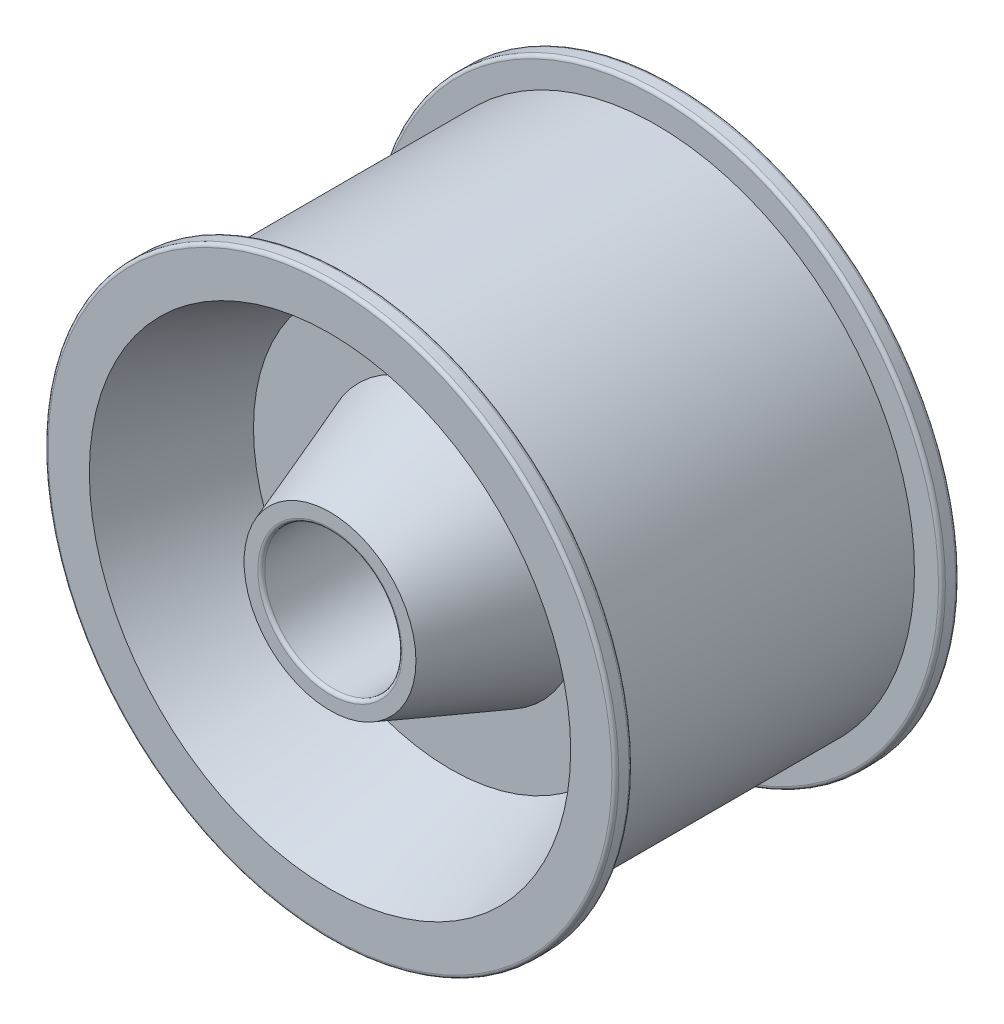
ISO-10303-21;
HEADER;
FILE_DESCRIPTION(('STEP AP214'),'2;1');
FILE_NAME('part.step','',(''),(''),'','','');
FILE_SCHEMA(('AUTOMOTIVE_DESIGN { 1 0 10303 214 1 1 1 1 }'));
ENDSEC;
DATA;
#1=APPLICATION_CONTEXT('core data for automotive mechanical design processes');
#2=APPLICATION_PROTOCOL_DEFINITION('international standard','automotive_design',2000,#1);
#3=PRODUCT_CONTEXT('',#1,'mechanical');
#4=PRODUCT('Part','Part','',(#3));
#5=PRODUCT_RELATED_PRODUCT_CATEGORY('part','',(#4));
#6=PRODUCT_DEFINITION_FORMATION('','',#4);
#7=PRODUCT_DEFINITION_CONTEXT('part definition',#1,'design');
#8=PRODUCT_DEFINITION('design','',#6,#7);
#9=PRODUCT_DEFINITION_SHAPE('','',#8);
#10=(LENGTH_UNIT() NAMED_UNIT(*) SI_UNIT(.MILLI.,.METRE.));
#11=(NAMED_UNIT(*) PLANE_ANGLE_UNIT() SI_UNIT($,.RADIAN.));
#12=(NAMED_UNIT(*) SI_UNIT($,.STERADIAN.) SOLID_ANGLE_UNIT());
#13=UNCERTAINTY_MEASURE_WITH_UNIT(LENGTH_MEASURE(1.E-05),#10,'distance_accuracy_value','');
#14=(GEOMETRIC_REPRESENTATION_CONTEXT(3) GLOBAL_UNCERTAINTY_ASSIGNED_CONTEXT((#13)) GLOBAL_UNIT_ASSIGNED_CONTEXT((#10,
#11,#12)) REPRESENTATION_CONTEXT('',''));
#15=CARTESIAN_POINT('',(0.,0.,0.));
#16=DIRECTION('',(0.,0.,1.));
#17=DIRECTION('',(1.,0.,0.));
#18=AXIS2_PLACEMENT_3D('',#15,#16,#17);
#19=CARTESIAN_POINT('',(0.,0.,-50.));
#20=DIRECTION('',(0.,0.,1.));
#21=DIRECTION('',(1.,0.,0.));
#22=AXIS2_PLACEMENT_3D('',#19,#20,#21);
#23=CONICAL_SURFACE('',#22,25.,0.349065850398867);
#24=CARTESIAN_POINT('',(0.,0.,-15.));
#25=DIRECTION('',(0.,0.,1.));
#26=DIRECTION('',(1.,0.,0.));
#27=AXIS2_PLACEMENT_3D('',#24,#25,#26);
#28=CIRCLE('',#27,37.7389581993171);
#29=CARTESIAN_POINT('',(37.7389581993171,0.,-15.));
#30=VERTEX_POINT('',#29);
#31=EDGE_CURVE('E10',#30,#30,#28,.T.);
#32=ORIENTED_EDGE('',*,*,#31,.F.);
#33=EDGE_LOOP('',(#32));
#34=FACE_BOUND('',#33,.T.);
#35=CARTESIAN_POINT('',(0.,0.,-50.));
#36=DIRECTION('',(0.,0.,1.));
#37=DIRECTION('',(1.,0.,0.));
#38=AXIS2_PLACEMENT_3D('',#35,#36,#37);
#39=CIRCLE('',#38,25.);
#40=CARTESIAN_POINT('',(25.,0.,-50.));
#41=VERTEX_POINT('',#40);
#42=EDGE_CURVE('E100',#41,#41,#39,.T.);
#43=ORIENTED_EDGE('',*,*,#42,.T.);
#44=EDGE_LOOP('',(#43));
#45=FACE_BOUND('',#44,.T.);
#46=ADVANCED_FACE('F30',(#34,#45),#23,.T.);
#47=CARTESIAN_POINT('',(0.,37.7389581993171,-15.));
#48=DIRECTION('',(0.,0.,1.));
#49=DIRECTION('',(1.,0.,0.));
#50=AXIS2_PLACEMENT_3D('',#47,#48,#49);
#51=PLANE('',#50);
#52=CARTESIAN_POINT('',(0.,0.,-15.));
#53=DIRECTION('',(0.,0.,1.));
#54=DIRECTION('',(1.,0.,0.));
#55=AXIS2_PLACEMENT_3D('',#52,#53,#54);
#56=CIRCLE('',#55,57.2610418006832);
#57=CARTESIAN_POINT('',(57.2610418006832,0.,-15.));
#58=VERTEX_POINT('',#57);
#59=EDGE_CURVE('E36',#58,#58,#56,.T.);
#60=ORIENTED_EDGE('',*,*,#59,.F.);
#61=EDGE_LOOP('',(#60));
#62=FACE_BOUND('',#61,.T.);
#63=ORIENTED_EDGE('',*,*,#31,.T.);
#64=EDGE_LOOP('',(#63));
#65=FACE_BOUND('',#64,.T.);
#66=ADVANCED_FACE('F221',(#62,#65),#51,.F.);
#67=CARTESIAN_POINT('',(0.,0.,-15.));
#68=DIRECTION('',(0.,0.,-1.));
#69=DIRECTION('',(-1.,0.,0.));
#70=AXIS2_PLACEMENT_3D('',#67,#68,#69);
#71=CONICAL_SURFACE('',#70,57.2610418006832,0.34906585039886);
#72=CARTESIAN_POINT('',(0.,0.,-50.));
#73=DIRECTION('',(0.,0.,1.));
#74=DIRECTION('',(1.,0.,0.));
#75=AXIS2_PLACEMENT_3D('',#72,#73,#74);
#76=CIRCLE('',#75,70.);
#77=CARTESIAN_POINT('',(70.,0.,-50.));
#78=VERTEX_POINT('',#77);
#79=EDGE_CURVE('E40',#78,#78,#76,.T.);
#80=ORIENTED_EDGE('',*,*,#79,.F.);
#81=EDGE_LOOP('',(#80));
#82=FACE_BOUND('',#81,.T.);
#83=ORIENTED_EDGE('',*,*,#59,.T.);
#84=EDGE_LOOP('',(#83));
#85=FACE_BOUND('',#84,.T.);
#86=ADVANCED_FACE('F216',(#82,#85),#71,.F.);
#87=CARTESIAN_POINT('',(0.,70.,-50.));
#88=DIRECTION('',(0.,0.,1.));
#89=DIRECTION('',(1.,0.,0.));
#90=AXIS2_PLACEMENT_3D('',#87,#88,#89);
#91=PLANE('',#90);
#92=CARTESIAN_POINT('',(0.,0.,-50.));
#93=DIRECTION('',(0.,0.,1.));
#94=DIRECTION('',(1.,0.,0.));
#95=AXIS2_PLACEMENT_3D('',#92,#93,#94);
#96=CIRCLE('',#95,82.);
#97=CARTESIAN_POINT('',(82.,0.,-50.));
#98=VERTEX_POINT('',#97);
#99=EDGE_CURVE('E44',#98,#98,#96,.T.);
#100=ORIENTED_EDGE('',*,*,#99,.F.);
#101=EDGE_LOOP('',(#100));
#102=FACE_BOUND('',#101,.T.);
#103=ORIENTED_EDGE('',*,*,#79,.T.);
#104=EDGE_LOOP('',(#103));
#105=FACE_BOUND('',#104,.T.);
#106=ADVANCED_FACE('F210',(#102,#105),#91,.F.);
#107=CARTESIAN_POINT('',(0.,0.,-49.));
#108=DIRECTION('',(0.,0.,1.));
#109=DIRECTION('',(1.,0.,0.));
#110=AXIS2_PLACEMENT_3D('',#107,#108,#109);
#111=TOROIDAL_SURFACE('',#110,82.,0.999999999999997);
#112=CARTESIAN_POINT('',(0.,0.,-49.));
#113=DIRECTION('',(0.,0.,1.));
#114=DIRECTION('',(1.,0.,0.));
#115=AXIS2_PLACEMENT_3D('',#112,#113,#114);
#116=CIRCLE('',#115,83.);
#117=CARTESIAN_POINT('',(83.,0.,-49.));
#118=VERTEX_POINT('',#117);
#119=EDGE_CURVE('E49',#118,#118,#116,.T.);
#120=ORIENTED_EDGE('',*,*,#119,.F.);
#121=EDGE_LOOP('',(#120));
#122=FACE_BOUND('',#121,.T.);
#123=ORIENTED_EDGE('',*,*,#99,.T.);
#124=EDGE_LOOP('',(#123));
#125=FACE_BOUND('',#124,.T.);
#126=ADVANCED_FACE('F204',(#122,#125),#111,.T.);
#127=CARTESIAN_POINT('',(0.,0.,69.0104166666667));
#128=DIRECTION('',(0.,0.,1.));
#129=DIRECTION('',(1.,0.,0.));
#130=AXIS2_PLACEMENT_3D('',#127,#128,#129);
#131=CYLINDRICAL_SURFACE('',#130,83.);
#132=CARTESIAN_POINT('',(0.,0.,-46.));
#133=DIRECTION('',(0.,0.,1.));
#134=DIRECTION('',(1.,0.,0.));
#135=AXIS2_PLACEMENT_3D('',#132,#133,#134);
#136=CIRCLE('',#135,83.);
#137=CARTESIAN_POINT('',(83.,0.,-46.));
#138=VERTEX_POINT('',#137);
#139=EDGE_CURVE('E52',#138,#138,#136,.T.);
#140=ORIENTED_EDGE('',*,*,#139,.F.);
#141=EDGE_LOOP('',(#140));
#142=FACE_BOUND('',#141,.T.);
#143=ORIENTED_EDGE('',*,*,#119,.T.);
#144=EDGE_LOOP('',(#143));
#145=FACE_BOUND('',#144,.T.);
#146=ADVANCED_FACE('F198',(#142,#145),#131,.T.);
#147=CARTESIAN_POINT('',(0.,0.,-46.));
#148=DIRECTION('',(0.,0.,1.));
#149=DIRECTION('',(1.,0.,0.));
#150=AXIS2_PLACEMENT_3D('',#147,#148,#149);
#151=TOROIDAL_SURFACE('',#150,82.,1.);
#152=CARTESIAN_POINT('',(0.,0.,-45.));
#153=DIRECTION('',(0.,0.,1.));
#154=DIRECTION('',(1.,0.,0.));
#155=AXIS2_PLACEMENT_3D('',#152,#153,#154);
#156=CIRCLE('',#155,82.);
#157=CARTESIAN_POINT('',(82.,0.,-45.));
#158=VERTEX_POINT('',#157);
#159=EDGE_CURVE('E55',#158,#158,#156,.T.);
#160=ORIENTED_EDGE('',*,*,#159,.F.);
#161=EDGE_LOOP('',(#160));
#162=FACE_BOUND('',#161,.T.);
#163=ORIENTED_EDGE('',*,*,#139,.T.);
#164=EDGE_LOOP('',(#163));
#165=FACE_BOUND('',#164,.T.);
#166=ADVANCED_FACE('F192',(#162,#165),#151,.T.);
#167=CARTESIAN_POINT('',(0.,82.,-45.));
#168=DIRECTION('',(0.,0.,-1.));
#169=DIRECTION('',(-1.,0.,0.));
#170=AXIS2_PLACEMENT_3D('',#167,#168,#169);
#171=PLANE('',#170);
#172=CARTESIAN_POINT('',(0.,0.,-45.));
#173=DIRECTION('',(0.,0.,1.));
#174=DIRECTION('',(1.,0.,0.));
#175=AXIS2_PLACEMENT_3D('',#172,#173,#174);
#176=CIRCLE('',#175,75.);
#177=CARTESIAN_POINT('',(75.,0.,-45.));
#178=VERTEX_POINT('',#177);
#179=EDGE_CURVE('E58',#178,#178,#176,.T.);
#180=ORIENTED_EDGE('',*,*,#179,.F.);
#181=EDGE_LOOP('',(#180));
#182=FACE_BOUND('',#181,.T.);
#183=ORIENTED_EDGE('',*,*,#159,.T.);
#184=EDGE_LOOP('',(#183));
#185=FACE_BOUND('',#184,.T.);
#186=ADVANCED_FACE('F186',(#182,#185),#171,.F.);
#187=CARTESIAN_POINT('',(0.,0.,69.0104166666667));
#188=DIRECTION('',(0.,0.,1.));
#189=DIRECTION('',(1.,0.,0.));
#190=AXIS2_PLACEMENT_3D('',#187,#188,#189);
#191=CYLINDRICAL_SURFACE('',#190,75.);
#192=CARTESIAN_POINT('',(0.,0.,45.));
#193=DIRECTION('',(0.,0.,1.));
#194=DIRECTION('',(1.,0.,0.));
#195=AXIS2_PLACEMENT_3D('',#192,#193,#194);
#196=CIRCLE('',#195,75.);
#197=CARTESIAN_POINT('',(75.,0.,45.));
#198=VERTEX_POINT('',#197);
#199=EDGE_CURVE('E61',#198,#198,#196,.T.);
#200=ORIENTED_EDGE('',*,*,#199,.F.);
#201=EDGE_LOOP('',(#200));
#202=FACE_BOUND('',#201,.T.);
#203=ORIENTED_EDGE('',*,*,#179,.T.);
#204=EDGE_LOOP('',(#203));
#205=FACE_BOUND('',#204,.T.);
#206=ADVANCED_FACE('F180',(#202,#205),#191,.T.);
#207=CARTESIAN_POINT('',(0.,82.,45.));
#208=DIRECTION('',(0.,0.,1.));
#209=DIRECTION('',(1.,0.,0.));
#210=AXIS2_PLACEMENT_3D('',#207,#208,#209);
#211=PLANE('',#210);
#212=CARTESIAN_POINT('',(0.,0.,45.));
#213=DIRECTION('',(0.,0.,1.));
#214=DIRECTION('',(1.,0.,0.));
#215=AXIS2_PLACEMENT_3D('',#212,#213,#214);
#216=CIRCLE('',#215,82.);
#217=CARTESIAN_POINT('',(82.,0.,45.));
#218=VERTEX_POINT('',#217);
#219=EDGE_CURVE('E64',#218,#218,#216,.T.);
#220=ORIENTED_EDGE('',*,*,#219,.F.);
#221=EDGE_LOOP('',(#220));
#222=FACE_BOUND('',#221,.T.);
#223=ORIENTED_EDGE('',*,*,#199,.T.);
#224=EDGE_LOOP('',(#223));
#225=FACE_BOUND('',#224,.T.);
#226=ADVANCED_FACE('F174',(#222,#225),#211,.F.);
#227=CARTESIAN_POINT('',(0.,0.,46.));
#228=DIRECTION('',(0.,0.,1.));
#229=DIRECTION('',(1.,0.,0.));
#230=AXIS2_PLACEMENT_3D('',#227,#228,#229);
#231=TOROIDAL_SURFACE('',#230,82.,1.);
#232=CARTESIAN_POINT('',(0.,0.,46.));
#233=DIRECTION('',(0.,0.,1.));
#234=DIRECTION('',(1.,0.,0.));
#235=AXIS2_PLACEMENT_3D('',#232,#233,#234);
#236=CIRCLE('',#235,83.);
#237=CARTESIAN_POINT('',(83.,0.,46.));
#238=VERTEX_POINT('',#237);
#239=EDGE_CURVE('E67',#238,#238,#236,.T.);
#240=ORIENTED_EDGE('',*,*,#239,.F.);
#241=EDGE_LOOP('',(#240));
#242=FACE_BOUND('',#241,.T.);
#243=ORIENTED_EDGE('',*,*,#219,.T.);
#244=EDGE_LOOP('',(#243));
#245=FACE_BOUND('',#244,.T.);
#246=ADVANCED_FACE('F168',(#242,#245),#231,.T.);
#247=CARTESIAN_POINT('',(0.,0.,69.0104166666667));
#248=DIRECTION('',(0.,0.,1.));
#249=DIRECTION('',(1.,0.,0.));
#250=AXIS2_PLACEMENT_3D('',#247,#248,#249);
#251=CYLINDRICAL_SURFACE('',#250,83.);
#252=CARTESIAN_POINT('',(0.,0.,49.));
#253=DIRECTION('',(0.,0.,1.));
#254=DIRECTION('',(1.,0.,0.));
#255=AXIS2_PLACEMENT_3D('',#252,#253,#254);
#256=CIRCLE('',#255,83.);
#257=CARTESIAN_POINT('',(83.,0.,49.));
#258=VERTEX_POINT('',#257);
#259=EDGE_CURVE('E70',#258,#258,#256,.T.);
#260=ORIENTED_EDGE('',*,*,#259,.F.);
#261=EDGE_LOOP('',(#260));
#262=FACE_BOUND('',#261,.T.);
#263=ORIENTED_EDGE('',*,*,#239,.T.);
#264=EDGE_LOOP('',(#263));
#265=FACE_BOUND('',#264,.T.);
#266=ADVANCED_FACE('F162',(#262,#265),#251,.T.);
#267=CARTESIAN_POINT('',(0.,0.,49.));
#268=DIRECTION('',(0.,0.,1.));
#269=DIRECTION('',(1.,0.,0.));
#270=AXIS2_PLACEMENT_3D('',#267,#268,#269);
#271=TOROIDAL_SURFACE('',#270,82.,0.999999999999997);
#272=CARTESIAN_POINT('',(0.,0.,50.));
#273=DIRECTION('',(0.,0.,1.));
#274=DIRECTION('',(1.,0.,0.));
#275=AXIS2_PLACEMENT_3D('',#272,#273,#274);
#276=CIRCLE('',#275,82.);
#277=CARTESIAN_POINT('',(82.,0.,50.));
#278=VERTEX_POINT('',#277);
#279=EDGE_CURVE('E73',#278,#278,#276,.T.);
#280=ORIENTED_EDGE('',*,*,#279,.F.);
#281=EDGE_LOOP('',(#280));
#282=FACE_BOUND('',#281,.T.);
#283=ORIENTED_EDGE('',*,*,#259,.T.);
#284=EDGE_LOOP('',(#283));
#285=FACE_BOUND('',#284,.T.);
#286=ADVANCED_FACE('F156',(#282,#285),#271,.T.);
#287=CARTESIAN_POINT('',(0.,70.,50.));
#288=DIRECTION('',(0.,0.,-1.));
#289=DIRECTION('',(-1.,0.,0.));
#290=AXIS2_PLACEMENT_3D('',#287,#288,#289);
#291=PLANE('',#290);
#292=CARTESIAN_POINT('',(0.,0.,50.));
#293=DIRECTION('',(0.,0.,1.));
#294=DIRECTION('',(1.,0.,0.));
#295=AXIS2_PLACEMENT_3D('',#292,#293,#294);
#296=CIRCLE('',#295,70.);
#297=CARTESIAN_POINT('',(70.,0.,50.));
#298=VERTEX_POINT('',#297);
#299=EDGE_CURVE('E76',#298,#298,#296,.T.);
#300=ORIENTED_EDGE('',*,*,#299,.F.);
#301=EDGE_LOOP('',(#300));
#302=FACE_BOUND('',#301,.T.);
#303=ORIENTED_EDGE('',*,*,#279,.T.);
#304=EDGE_LOOP('',(#303));
#305=FACE_BOUND('',#304,.T.);
#306=ADVANCED_FACE('F150',(#302,#305),#291,.F.);
#307=CARTESIAN_POINT('',(0.,0.,50.));
#308=DIRECTION('',(0.,0.,1.));
#309=DIRECTION('',(1.,0.,0.));
#310=AXIS2_PLACEMENT_3D('',#307,#308,#309);
#311=CONICAL_SURFACE('',#310,70.,0.34906585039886);
#312=CARTESIAN_POINT('',(0.,0.,15.));
#313=DIRECTION('',(0.,0.,1.));
#314=DIRECTION('',(1.,0.,0.));
#315=AXIS2_PLACEMENT_3D('',#312,#313,#314);
#316=CIRCLE('',#315,57.2610418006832);
#317=CARTESIAN_POINT('',(57.2610418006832,0.,15.));
#318=VERTEX_POINT('',#317);
#319=EDGE_CURVE('E79',#318,#318,#316,.T.);
#320=ORIENTED_EDGE('',*,*,#319,.F.);
#321=EDGE_LOOP('',(#320));
#322=FACE_BOUND('',#321,.T.);
#323=ORIENTED_EDGE('',*,*,#299,.T.);
#324=EDGE_LOOP('',(#323));
#325=FACE_BOUND('',#324,.T.);
#326=ADVANCED_FACE('F144',(#322,#325),#311,.F.);
#327=CARTESIAN_POINT('',(0.,37.7389581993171,15.));
#328=DIRECTION('',(0.,0.,-1.));
#329=DIRECTION('',(-1.,0.,0.));
#330=AXIS2_PLACEMENT_3D('',#327,#328,#329);
#331=PLANE('',#330);
#332=CARTESIAN_POINT('',(0.,0.,15.));
#333=DIRECTION('',(0.,0.,1.));
#334=DIRECTION('',(1.,0.,0.));
#335=AXIS2_PLACEMENT_3D('',#332,#333,#334);
#336=CIRCLE('',#335,37.7389581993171);
#337=CARTESIAN_POINT('',(37.7389581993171,0.,15.));
#338=VERTEX_POINT('',#337);
#339=EDGE_CURVE('E82',#338,#338,#336,.T.);
#340=ORIENTED_EDGE('',*,*,#339,.F.);
#341=EDGE_LOOP('',(#340));
#342=FACE_BOUND('',#341,.T.);
#343=ORIENTED_EDGE('',*,*,#319,.T.);
#344=EDGE_LOOP('',(#343));
#345=FACE_BOUND('',#344,.T.);
#346=ADVANCED_FACE('F138',(#342,#345),#331,.F.);
#347=CARTESIAN_POINT('',(0.,0.,15.));
#348=DIRECTION('',(0.,0.,-1.));
#349=DIRECTION('',(-1.,0.,0.));
#350=AXIS2_PLACEMENT_3D('',#347,#348,#349);
#351=CONICAL_SURFACE('',#350,37.7389581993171,0.349065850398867);
#352=CARTESIAN_POINT('',(0.,0.,50.));
#353=DIRECTION('',(0.,0.,1.));
#354=DIRECTION('',(1.,0.,0.));
#355=AXIS2_PLACEMENT_3D('',#352,#353,#354);
#356=CIRCLE('',#355,25.);
#357=CARTESIAN_POINT('',(25.,0.,50.));
#358=VERTEX_POINT('',#357);
#359=EDGE_CURVE('E85',#358,#358,#356,.T.);
#360=ORIENTED_EDGE('',*,*,#359,.F.);
#361=EDGE_LOOP('',(#360));
#362=FACE_BOUND('',#361,.T.);
#363=ORIENTED_EDGE('',*,*,#339,.T.);
#364=EDGE_LOOP('',(#363));
#365=FACE_BOUND('',#364,.T.);
#366=ADVANCED_FACE('F132',(#362,#365),#351,.T.);
#367=CARTESIAN_POINT('',(0.,21.,50.));
#368=DIRECTION('',(0.,0.,-1.));
#369=DIRECTION('',(-1.,0.,0.));
#370=AXIS2_PLACEMENT_3D('',#367,#368,#369);
#371=PLANE('',#370);
#372=CARTESIAN_POINT('',(0.,0.,50.));
#373=DIRECTION('',(0.,0.,1.));
#374=DIRECTION('',(1.,0.,0.));
#375=AXIS2_PLACEMENT_3D('',#372,#373,#374);
#376=CIRCLE('',#375,21.);
#377=CARTESIAN_POINT('',(21.,0.,50.));
#378=VERTEX_POINT('',#377);
#379=EDGE_CURVE('E88',#378,#378,#376,.T.);
#380=ORIENTED_EDGE('',*,*,#379,.F.);
#381=EDGE_LOOP('',(#380));
#382=FACE_BOUND('',#381,.T.);
#383=ORIENTED_EDGE('',*,*,#359,.T.);
#384=EDGE_LOOP('',(#383));
#385=FACE_BOUND('',#384,.T.);
#386=ADVANCED_FACE('F126',(#382,#385),#371,.F.);
#387=CARTESIAN_POINT('',(0.,0.,49.));
#388=DIRECTION('',(0.,0.,1.));
#389=DIRECTION('',(1.,0.,0.));
#390=AXIS2_PLACEMENT_3D('',#387,#388,#389);
#391=TOROIDAL_SURFACE('',#390,21.,0.999999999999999);
#392=CARTESIAN_POINT('',(0.,0.,49.));
#393=DIRECTION('',(0.,0.,1.));
#394=DIRECTION('',(1.,0.,0.));
#395=AXIS2_PLACEMENT_3D('',#392,#393,#394);
#396=CIRCLE('',#395,20.);
#397=CARTESIAN_POINT('',(20.,0.,49.));
#398=VERTEX_POINT('',#397);
#399=EDGE_CURVE('E91',#398,#398,#396,.T.);
#400=ORIENTED_EDGE('',*,*,#399,.F.);
#401=EDGE_LOOP('',(#400));
#402=FACE_BOUND('',#401,.T.);
#403=ORIENTED_EDGE('',*,*,#379,.T.);
#404=EDGE_LOOP('',(#403));
#405=FACE_BOUND('',#404,.T.);
#406=ADVANCED_FACE('F120',(#402,#405),#391,.T.);
#407=CARTESIAN_POINT('',(0.,0.,69.0104166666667));
#408=DIRECTION('',(0.,0.,1.));
#409=DIRECTION('',(1.,0.,0.));
#410=AXIS2_PLACEMENT_3D('',#407,#408,#409);
#411=CYLINDRICAL_SURFACE('',#410,20.);
#412=CARTESIAN_POINT('',(0.,0.,-49.));
#413=DIRECTION('',(0.,0.,1.));
#414=DIRECTION('',(1.,0.,0.));
#415=AXIS2_PLACEMENT_3D('',#412,#413,#414);
#416=CIRCLE('',#415,20.);
#417=CARTESIAN_POINT('',(20.,0.,-49.));
#418=VERTEX_POINT('',#417);
#419=EDGE_CURVE('E94',#418,#418,#416,.T.);
#420=ORIENTED_EDGE('',*,*,#419,.F.);
#421=EDGE_LOOP('',(#420));
#422=FACE_BOUND('',#421,.T.);
#423=ORIENTED_EDGE('',*,*,#399,.T.);
#424=EDGE_LOOP('',(#423));
#425=FACE_BOUND('',#424,.T.);
#426=ADVANCED_FACE('F114',(#422,#425),#411,.F.);
#427=CARTESIAN_POINT('',(0.,0.,-49.));
#428=DIRECTION('',(0.,0.,1.));
#429=DIRECTION('',(1.,0.,0.));
#430=AXIS2_PLACEMENT_3D('',#427,#428,#429);
#431=TOROIDAL_SURFACE('',#430,21.,0.999999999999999);
#432=CARTESIAN_POINT('',(0.,0.,-50.));
#433=DIRECTION('',(0.,0.,1.));
#434=DIRECTION('',(1.,0.,0.));
#435=AXIS2_PLACEMENT_3D('',#432,#433,#434);
#436=CIRCLE('',#435,21.);
#437=CARTESIAN_POINT('',(21.,0.,-50.));
#438=VERTEX_POINT('',#437);
#439=EDGE_CURVE('E97',#438,#438,#436,.T.);
#440=ORIENTED_EDGE('',*,*,#439,.F.);
#441=EDGE_LOOP('',(#440));
#442=FACE_BOUND('',#441,.T.);
#443=ORIENTED_EDGE('',*,*,#419,.T.);
#444=EDGE_LOOP('',(#443));
#445=FACE_BOUND('',#444,.T.);
#446=ADVANCED_FACE('F108',(#442,#445),#431,.T.);
#447=CARTESIAN_POINT('',(0.,21.,-50.));
#448=DIRECTION('',(0.,0.,1.));
#449=DIRECTION('',(1.,0.,0.));
#450=AXIS2_PLACEMENT_3D('',#447,#448,#449);
#451=PLANE('',#450);
#452=ORIENTED_EDGE('',*,*,#42,.F.);
#453=EDGE_LOOP('',(#452));
#454=FACE_BOUND('',#453,.T.);
#455=ORIENTED_EDGE('',*,*,#439,.T.);
#456=EDGE_LOOP('',(#455));
#457=FACE_BOUND('',#456,.T.);
#458=ADVANCED_FACE('F105',(#454,#457),#451,.F.);
#459=CLOSED_SHELL('',(#46,#66,#86,#106,#126,#146,#166,#186,#206,#226,#246,#266,#286,#306,#326,
#346,#366,#386,#406,#426,#446,#458));
#460=MANIFOLD_SOLID_BREP('B2',#459);
#461=ADVANCED_BREP_SHAPE_REPRESENTATION('',(#18,#460),#14);
#462=SHAPE_DEFINITION_REPRESENTATION(#9,#461);
ENDSEC;
END-ISO-10303-21;
